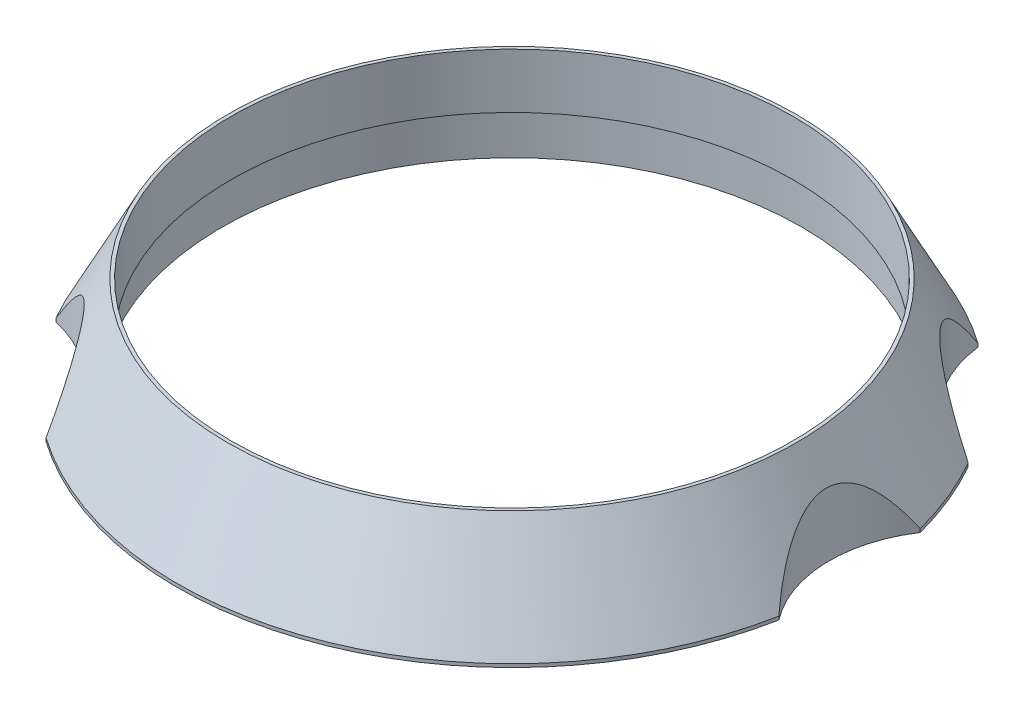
ISO-10303-21;
HEADER;
FILE_DESCRIPTION(('STEP AP214'),'2;1');
FILE_NAME('part.step','',(''),(''),'','','');
FILE_SCHEMA(('AUTOMOTIVE_DESIGN { 1 0 10303 214 1 1 1 1 }'));
ENDSEC;
DATA;
#1=APPLICATION_CONTEXT('core data for automotive mechanical design processes');
#2=APPLICATION_PROTOCOL_DEFINITION('international standard','automotive_design',2000,#1);
#3=PRODUCT_CONTEXT('',#1,'mechanical');
#4=PRODUCT('Part','Part','',(#3));
#5=PRODUCT_RELATED_PRODUCT_CATEGORY('part','',(#4));
#6=PRODUCT_DEFINITION_FORMATION('','',#4);
#7=PRODUCT_DEFINITION_CONTEXT('part definition',#1,'design');
#8=PRODUCT_DEFINITION('design','',#6,#7);
#9=PRODUCT_DEFINITION_SHAPE('','',#8);
#10=(LENGTH_UNIT() NAMED_UNIT(*) SI_UNIT(.MILLI.,.METRE.));
#11=(NAMED_UNIT(*) PLANE_ANGLE_UNIT() SI_UNIT($,.RADIAN.));
#12=(NAMED_UNIT(*) SI_UNIT($,.STERADIAN.) SOLID_ANGLE_UNIT());
#13=UNCERTAINTY_MEASURE_WITH_UNIT(LENGTH_MEASURE(1.E-05),#10,'distance_accuracy_value','');
#14=(GEOMETRIC_REPRESENTATION_CONTEXT(3) GLOBAL_UNCERTAINTY_ASSIGNED_CONTEXT((#13)) GLOBAL_UNIT_ASSIGNED_CONTEXT((#10,
#11,#12)) REPRESENTATION_CONTEXT('',''));
#15=CARTESIAN_POINT('',(0.,0.,0.));
#16=DIRECTION('',(0.,0.,1.));
#17=DIRECTION('',(1.,0.,0.));
#18=AXIS2_PLACEMENT_3D('',#15,#16,#17);
#19=CARTESIAN_POINT('',(-127.,0.,0.));
#20=DIRECTION('',(0.,1.,0.));
#21=DIRECTION('',(0.,0.,1.));
#22=AXIS2_PLACEMENT_3D('',#19,#20,#21);
#23=PLANE('',#22);
#24=CARTESIAN_POINT('',(95.7821391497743,0.,66.9242207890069));
#25=DIRECTION('',(0.,-1.,0.));
#26=DIRECTION('',(0.,0.,-1.));
#27=AXIS2_PLACEMENT_3D('',#24,#25,#26);
#28=CIRCLE('',#27,3.175);
#29=CARTESIAN_POINT('',(95.7821391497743,0.,63.7492207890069));
#30=VERTEX_POINT('',#29);
#31=EDGE_CURVE('E470',#30,#30,#28,.T.);
#32=ORIENTED_EDGE('',*,*,#31,.F.);
#33=EDGE_LOOP('',(#32));
#34=FACE_BOUND('',#33,.T.);
#35=CARTESIAN_POINT('',(-95.7821391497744,0.,-66.9242207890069));
#36=DIRECTION('',(0.,-1.,0.));
#37=DIRECTION('',(0.,0.,-1.));
#38=AXIS2_PLACEMENT_3D('',#35,#36,#37);
#39=CIRCLE('',#38,3.175);
#40=CARTESIAN_POINT('',(-95.7821391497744,0.,-70.0992207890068));
#41=VERTEX_POINT('',#40);
#42=EDGE_CURVE('E480',#41,#41,#39,.T.);
#43=ORIENTED_EDGE('',*,*,#42,.F.);
#44=EDGE_LOOP('',(#43));
#45=FACE_BOUND('',#44,.T.);
#46=CARTESIAN_POINT('',(-21.8546279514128,0.,114.784340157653));
#47=DIRECTION('',(0.,-1.,0.));
#48=DIRECTION('',(0.,0.,-1.));
#49=AXIS2_PLACEMENT_3D('',#46,#47,#48);
#50=CIRCLE('',#49,3.17499999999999);
#51=CARTESIAN_POINT('',(-21.8546279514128,0.,111.609340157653));
#52=VERTEX_POINT('',#51);
#53=EDGE_CURVE('E492',#52,#52,#50,.T.);
#54=ORIENTED_EDGE('',*,*,#53,.F.);
#55=EDGE_LOOP('',(#54));
#56=FACE_BOUND('',#55,.T.);
#57=CARTESIAN_POINT('',(0.,0.,0.));
#58=DIRECTION('',(0.,-1.,0.));
#59=DIRECTION('',(0.,0.,-1.));
#60=AXIS2_PLACEMENT_3D('',#57,#58,#59);
#61=CIRCLE('',#60,127.);
#62=CARTESIAN_POINT('',(110.378100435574,0.,-62.8146077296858));
#63=VERTEX_POINT('',#62);
#64=CARTESIAN_POINT('',(122.880059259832,0.,-32.0856827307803));
#65=VERTEX_POINT('',#64);
#66=EDGE_CURVE('E109',#63,#65,#61,.T.);
#67=ORIENTED_EDGE('',*,*,#66,.T.);
#68=CARTESIAN_POINT('',(162.780464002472,0.,-5.62143623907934));
#69=DIRECTION('',(0.,1.,0.));
#70=DIRECTION('',(0.,0.,1.));
#71=AXIS2_PLACEMENT_3D('',#68,#69,#70);
#72=CIRCLE('',#71,47.879);
#73=CARTESIAN_POINT('',(124.800762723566,0.,23.5323102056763));
#74=VERTEX_POINT('',#73);
#75=EDGE_CURVE('E94',#65,#74,#72,.T.);
#76=ORIENTED_EDGE('',*,*,#75,.T.);
#77=CARTESIAN_POINT('',(-72.9243915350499,0.,103.976118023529));
#78=VERTEX_POINT('',#77);
#79=EDGE_CURVE('E117',#74,#78,#61,.T.);
#80=ORIENTED_EDGE('',*,*,#79,.T.);
#81=CARTESIAN_POINT('',(-120.469822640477,0.,109.617981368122));
#82=DIRECTION('',(0.,1.,0.));
#83=DIRECTION('',(0.,0.,1.));
#84=AXIS2_PLACEMENT_3D('',#81,#82,#83);
#85=CIRCLE('',#84,47.879);
#86=CARTESIAN_POINT('',(-110.378100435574,0.,62.8146077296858));
#87=VERTEX_POINT('',#86);
#88=EDGE_CURVE('E211',#78,#87,#85,.T.);
#89=ORIENTED_EDGE('',*,*,#88,.T.);
#90=CARTESIAN_POINT('',(-122.880059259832,0.,32.0856827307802));
#91=VERTEX_POINT('',#90);
#92=EDGE_CURVE('E119',#87,#91,#61,.T.);
#93=ORIENTED_EDGE('',*,*,#92,.T.);
#94=CARTESIAN_POINT('',(-162.780464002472,0.,5.62143623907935));
#95=DIRECTION('',(0.,1.,0.));
#96=DIRECTION('',(0.,0.,1.));
#97=AXIS2_PLACEMENT_3D('',#94,#95,#96);
#98=CIRCLE('',#97,47.879);
#99=CARTESIAN_POINT('',(-124.800762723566,0.,-23.5323102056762));
#100=VERTEX_POINT('',#99);
#101=EDGE_CURVE('E198',#91,#100,#98,.T.);
#102=ORIENTED_EDGE('',*,*,#101,.T.);
#103=CARTESIAN_POINT('',(72.9243915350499,0.,-103.976118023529));
#104=VERTEX_POINT('',#103);
#105=EDGE_CURVE('E116',#100,#104,#61,.T.);
#106=ORIENTED_EDGE('',*,*,#105,.T.);
#107=CARTESIAN_POINT('',(120.469822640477,0.,-109.617981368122));
#108=DIRECTION('',(0.,1.,0.));
#109=DIRECTION('',(0.,0.,1.));
#110=AXIS2_PLACEMENT_3D('',#107,#108,#109);
#111=CIRCLE('',#110,47.879);
#112=EDGE_CURVE('E115',#104,#63,#111,.T.);
#113=ORIENTED_EDGE('',*,*,#112,.T.);
#114=EDGE_LOOP('',(#67,#76,#80,#89,#93,#102,#106,#113));
#115=FACE_BOUND('',#114,.T.);
#116=CARTESIAN_POINT('',(0.,0.,0.));
#117=DIRECTION('',(0.,-1.,0.));
#118=DIRECTION('',(0.,0.,-1.));
#119=AXIS2_PLACEMENT_3D('',#116,#117,#118);
#120=CIRCLE('',#119,110.045499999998);
#121=CARTESIAN_POINT('',(0.,0.,-110.045499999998));
#122=VERTEX_POINT('',#121);
#123=EDGE_CURVE('E123',#122,#122,#120,.T.);
#124=ORIENTED_EDGE('',*,*,#123,.F.);
#125=EDGE_LOOP('',(#124));
#126=FACE_BOUND('',#125,.T.);
#127=CARTESIAN_POINT('',(21.8546279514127,0.,-114.784340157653));
#128=DIRECTION('',(0.,-1.,0.));
#129=DIRECTION('',(0.,0.,-1.));
#130=AXIS2_PLACEMENT_3D('',#127,#128,#129);
#131=CIRCLE('',#130,3.17499999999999);
#132=CARTESIAN_POINT('',(21.8546279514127,0.,-117.959340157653));
#133=VERTEX_POINT('',#132);
#134=EDGE_CURVE('E504',#133,#133,#131,.T.);
#135=ORIENTED_EDGE('',*,*,#134,.F.);
#136=EDGE_LOOP('',(#135));
#137=FACE_BOUND('',#136,.T.);
#138=ADVANCED_FACE('F32',(#34,#45,#56,#115,#126,#137),#23,.F.);
#139=CARTESIAN_POINT('',(0.,0.,0.));
#140=DIRECTION('',(0.,-1.,0.));
#141=DIRECTION('',(0.,0.,-1.));
#142=AXIS2_PLACEMENT_3D('',#139,#140,#141);
#143=CYLINDRICAL_SURFACE('',#142,127.);
#144=ORIENTED_EDGE('',*,*,#79,.F.);
#145=DIRECTION('',(0.,1.,0.));
#146=VECTOR('',#145,1.);
#147=CARTESIAN_POINT('',(124.800762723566,19.05,23.5323102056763));
#148=LINE('',#147,#146);
#149=CARTESIAN_POINT('',(124.800762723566,1.27,23.5323102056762));
#150=VERTEX_POINT('',#149);
#151=EDGE_CURVE('E47',#74,#150,#148,.T.);
#152=ORIENTED_EDGE('',*,*,#151,.T.);
#153=CARTESIAN_POINT('',(0.,1.27,0.));
#154=DIRECTION('',(0.,-1.,0.));
#155=DIRECTION('',(0.,0.,-1.));
#156=AXIS2_PLACEMENT_3D('',#153,#154,#155);
#157=CIRCLE('',#156,127.);
#158=CARTESIAN_POINT('',(-72.9243915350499,1.27,103.976118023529));
#159=VERTEX_POINT('',#158);
#160=EDGE_CURVE('E242',#150,#159,#157,.T.);
#161=ORIENTED_EDGE('',*,*,#160,.T.);
#162=DIRECTION('',(0.,1.,0.));
#163=VECTOR('',#162,1.);
#164=CARTESIAN_POINT('',(-72.9243915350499,19.05,103.976118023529));
#165=LINE('',#164,#163);
#166=EDGE_CURVE('E208',#159,#78,#165,.F.);
#167=ORIENTED_EDGE('',*,*,#166,.T.);
#168=EDGE_LOOP('',(#144,#152,#161,#167));
#169=FACE_BOUND('',#168,.T.);
#170=ADVANCED_FACE('F173',(#169),#143,.T.);
#171=CARTESIAN_POINT('',(110.378100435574,1.27,-62.8146077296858));
#172=VERTEX_POINT('',#171);
#173=CARTESIAN_POINT('',(122.880059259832,1.26999999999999,-32.0856827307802));
#174=VERTEX_POINT('',#173);
#175=EDGE_CURVE('E111',#172,#174,#157,.T.);
#176=ORIENTED_EDGE('',*,*,#175,.T.);
#177=DIRECTION('',(0.,1.,0.));
#178=VECTOR('',#177,1.);
#179=CARTESIAN_POINT('',(122.880059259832,19.05,-32.0856827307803));
#180=LINE('',#179,#178);
#181=EDGE_CURVE('E97',#174,#65,#180,.F.);
#182=ORIENTED_EDGE('',*,*,#181,.T.);
#183=ORIENTED_EDGE('',*,*,#66,.F.);
#184=DIRECTION('',(0.,1.,0.));
#185=VECTOR('',#184,1.);
#186=CARTESIAN_POINT('',(110.378100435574,19.05,-62.8146077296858));
#187=LINE('',#186,#185);
#188=EDGE_CURVE('E55',#63,#172,#187,.T.);
#189=ORIENTED_EDGE('',*,*,#188,.T.);
#190=EDGE_LOOP('',(#176,#182,#183,#189));
#191=FACE_BOUND('',#190,.T.);
#192=ADVANCED_FACE('F108',(#191),#143,.T.);
#193=ORIENTED_EDGE('',*,*,#92,.F.);
#194=DIRECTION('',(0.,1.,0.));
#195=VECTOR('',#194,1.);
#196=CARTESIAN_POINT('',(-110.378100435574,19.05,62.8146077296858));
#197=LINE('',#196,#195);
#198=CARTESIAN_POINT('',(-110.378100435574,1.27,62.8146077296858));
#199=VERTEX_POINT('',#198);
#200=EDGE_CURVE('E195',#87,#199,#197,.T.);
#201=ORIENTED_EDGE('',*,*,#200,.T.);
#202=CARTESIAN_POINT('',(-122.880059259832,1.27,32.0856827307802));
#203=VERTEX_POINT('',#202);
#204=EDGE_CURVE('E120',#199,#203,#157,.T.);
#205=ORIENTED_EDGE('',*,*,#204,.T.);
#206=DIRECTION('',(0.,1.,0.));
#207=VECTOR('',#206,1.);
#208=CARTESIAN_POINT('',(-122.880059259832,19.05,32.0856827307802));
#209=LINE('',#208,#207);
#210=EDGE_CURVE('E149',#203,#91,#209,.F.);
#211=ORIENTED_EDGE('',*,*,#210,.T.);
#212=EDGE_LOOP('',(#193,#201,#205,#211));
#213=FACE_BOUND('',#212,.T.);
#214=ADVANCED_FACE('F177',(#213),#143,.T.);
#215=CARTESIAN_POINT('',(0.,0.,0.));
#216=DIRECTION('',(0.,-1.,0.));
#217=DIRECTION('',(0.,0.,-1.));
#218=AXIS2_PLACEMENT_3D('',#215,#216,#217);
#219=CYLINDRICAL_SURFACE('',#218,106.6927);
#220=CARTESIAN_POINT('',(0.,38.1,0.));
#221=DIRECTION('',(0.,-1.,0.));
#222=DIRECTION('',(0.,0.,-1.));
#223=AXIS2_PLACEMENT_3D('',#220,#221,#222);
#224=CIRCLE('',#223,106.6927);
#225=CARTESIAN_POINT('',(0.,38.1,-106.6927));
#226=VERTEX_POINT('',#225);
#227=EDGE_CURVE('E11',#226,#226,#224,.T.);
#228=ORIENTED_EDGE('',*,*,#227,.F.);
#229=EDGE_LOOP('',(#228));
#230=FACE_BOUND('',#229,.T.);
#231=CARTESIAN_POINT('',(0.,17.2720000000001,0.));
#232=DIRECTION('',(0.,-1.,0.));
#233=DIRECTION('',(0.,0.,-1.));
#234=AXIS2_PLACEMENT_3D('',#231,#232,#233);
#235=CIRCLE('',#234,106.6927);
#236=CARTESIAN_POINT('',(0.,17.2720000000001,-106.6927));
#237=VERTEX_POINT('',#236);
#238=EDGE_CURVE('E133',#237,#237,#235,.T.);
#239=ORIENTED_EDGE('',*,*,#238,.T.);
#240=EDGE_LOOP('',(#239));
#241=FACE_BOUND('',#240,.T.);
#242=ADVANCED_FACE('F34',(#230,#241),#219,.F.);
#243=CARTESIAN_POINT('',(-106.6927,38.1,0.));
#244=DIRECTION('',(0.,-1.,0.));
#245=DIRECTION('',(0.,0.,-1.));
#246=AXIS2_PLACEMENT_3D('',#243,#244,#245);
#247=PLANE('',#246);
#248=CARTESIAN_POINT('',(0.,38.1,0.));
#249=DIRECTION('',(0.,-1.,0.));
#250=DIRECTION('',(0.,0.,-1.));
#251=AXIS2_PLACEMENT_3D('',#248,#249,#250);
#252=CIRCLE('',#251,107.9627);
#253=CARTESIAN_POINT('',(0.,38.1,-107.9627));
#254=VERTEX_POINT('',#253);
#255=EDGE_CURVE('E40',#254,#254,#252,.T.);
#256=ORIENTED_EDGE('',*,*,#255,.F.);
#257=EDGE_LOOP('',(#256));
#258=FACE_BOUND('',#257,.T.);
#259=ORIENTED_EDGE('',*,*,#227,.T.);
#260=EDGE_LOOP('',(#259));
#261=FACE_BOUND('',#260,.T.);
#262=ADVANCED_FACE('F181',(#258,#261),#247,.F.);
#263=CARTESIAN_POINT('',(0.,38.1,0.));
#264=DIRECTION('',(0.,-1.,0.));
#265=DIRECTION('',(0.,0.,-1.));
#266=AXIS2_PLACEMENT_3D('',#263,#264,#265);
#267=CONICAL_SURFACE('',#266,107.9627,0.4770732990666);
#268=ORIENTED_EDGE('',*,*,#160,.F.);
#269=CARTESIAN_POINT('',(124.800847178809,1.26979999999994,23.5324202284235));
#270=CARTESIAN_POINT('',(124.629646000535,1.67522366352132,23.3093869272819));
#271=CARTESIAN_POINT('',(124.459270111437,2.07935001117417,23.0833705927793));
#272=CARTESIAN_POINT('',(124.120230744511,2.88478749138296,22.6250908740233));
#273=CARTESIAN_POINT('',(123.951567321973,3.28609853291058,22.3928272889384));
#274=CARTESIAN_POINT('',(123.448121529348,4.48575672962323,21.6860786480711));
#275=CARTESIAN_POINT('',(123.116019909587,5.27950612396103,21.2018126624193));
#276=CARTESIAN_POINT('',(122.455669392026,6.86194271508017,20.1986079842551));
#277=CARTESIAN_POINT('',(122.127518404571,7.65044699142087,19.6793155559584));
#278=CARTESIAN_POINT('',(121.480329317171,9.2089848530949,18.608481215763));
#279=CARTESIAN_POINT('',(121.161289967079,9.97902096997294,18.0569437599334));
#280=CARTESIAN_POINT('',(120.519880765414,11.5295923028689,16.8930587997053));
#281=CARTESIAN_POINT('',(120.19797233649,12.3091211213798,16.2791083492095));
#282=CARTESIAN_POINT('',(119.56733008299,13.8373842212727,15.0068940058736));
#283=CARTESIAN_POINT('',(119.258600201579,14.5861092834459,14.3486169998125));
#284=CARTESIAN_POINT('',(118.658735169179,16.0399731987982,12.9856442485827));
#285=CARTESIAN_POINT('',(118.367518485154,16.7453144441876,12.2812017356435));
#286=CARTESIAN_POINT('',(117.805003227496,18.1041318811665,10.8169709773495));
#287=CARTESIAN_POINT('',(117.53368791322,18.757651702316,10.0572303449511));
#288=CARTESIAN_POINT('',(117.129780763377,19.7247579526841,8.82264779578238));
#289=CARTESIAN_POINT('',(116.988518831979,20.0617659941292,8.36892795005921));
#290=CARTESIAN_POINT('',(116.715186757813,20.7105441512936,7.44083815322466));
#291=CARTESIAN_POINT('',(116.583118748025,21.0223084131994,6.96646345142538));
#292=CARTESIAN_POINT('',(116.330289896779,21.6147154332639,5.99875623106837));
#293=CARTESIAN_POINT('',(116.209480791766,21.8954920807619,5.50551875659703));
#294=CARTESIAN_POINT('',(115.980231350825,22.4224874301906,4.49803463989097));
#295=CARTESIAN_POINT('',(115.8717907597,22.6687068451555,3.98378843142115));
#296=CARTESIAN_POINT('',(115.667538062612,23.1247807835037,2.92639738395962));
#297=CARTESIAN_POINT('',(115.571964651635,23.3339660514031,2.38291513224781));
#298=CARTESIAN_POINT('',(115.397762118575,23.7048305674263,1.27720581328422));
#299=CARTESIAN_POINT('',(115.319132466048,23.8665113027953,0.714979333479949));
#300=CARTESIAN_POINT('',(115.180987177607,24.1365435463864,-0.423673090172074));
#301=CARTESIAN_POINT('',(115.121443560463,24.2449732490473,-1.00007690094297));
#302=CARTESIAN_POINT('',(115.023009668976,24.4044811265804,-2.16251677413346));
#303=CARTESIAN_POINT('',(114.984115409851,24.4555703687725,-2.74855095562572));
#304=CARTESIAN_POINT('',(114.931604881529,24.4954564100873,-3.84732430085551));
#305=CARTESIAN_POINT('',(114.915359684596,24.491488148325,-4.35968730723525));
#306=CARTESIAN_POINT('',(114.899331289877,24.4386787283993,-5.38229925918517));
#307=CARTESIAN_POINT('',(114.899546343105,24.3898423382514,-5.89254842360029));
#308=CARTESIAN_POINT('',(114.916038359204,24.2488337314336,-6.90717992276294));
#309=CARTESIAN_POINT('',(114.93232992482,24.156622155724,-7.41155650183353));
#310=CARTESIAN_POINT('',(114.980146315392,23.9316656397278,-8.41042495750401));
#311=CARTESIAN_POINT('',(115.011673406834,23.7989146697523,-8.90491535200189));
#312=CARTESIAN_POINT('',(115.097356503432,23.4630053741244,-9.9891903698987));
#313=CARTESIAN_POINT('',(115.154972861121,23.2507718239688,-10.5758952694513));
#314=CARTESIAN_POINT('',(115.288847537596,22.7784027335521,-11.7272848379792));
#315=CARTESIAN_POINT('',(115.36511069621,22.5182547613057,-12.2919637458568));
#316=CARTESIAN_POINT('',(115.618532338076,21.6757721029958,-13.9524472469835));
#317=CARTESIAN_POINT('',(115.820234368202,21.0317386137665,-15.0136727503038));
#318=CARTESIAN_POINT('',(116.142874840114,20.0298800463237,-16.4626894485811));
#319=CARTESIAN_POINT('',(116.244182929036,19.7185609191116,-16.8890689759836));
#320=CARTESIAN_POINT('',(116.454755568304,19.077465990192,-17.725698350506));
#321=CARTESIAN_POINT('',(116.564018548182,18.7476938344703,-18.1359513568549));
#322=CARTESIAN_POINT('',(116.902539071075,17.7340960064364,-19.344257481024));
#323=CARTESIAN_POINT('',(117.142405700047,17.0263687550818,-20.1193198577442));
#324=CARTESIAN_POINT('',(117.645827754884,15.5600348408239,-21.6180193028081));
#325=CARTESIAN_POINT('',(117.90948589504,14.8012115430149,-22.3414066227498));
#326=CARTESIAN_POINT('',(118.455490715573,13.2469051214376,-23.7393305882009));
#327=CARTESIAN_POINT('',(118.737831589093,12.4514334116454,-24.4138822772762));
#328=CARTESIAN_POINT('',(119.324034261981,10.8158520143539,-25.7328316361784));
#329=CARTESIAN_POINT('',(119.628209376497,9.97517305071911,-26.3763793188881));
#330=CARTESIAN_POINT('',(120.250808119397,8.26999263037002,-27.6240044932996));
#331=CARTESIAN_POINT('',(120.569234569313,7.40548646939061,-28.2280741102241));
#332=CARTESIAN_POINT('',(121.213732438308,5.67051389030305,-29.3920332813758));
#333=CARTESIAN_POINT('',(121.539618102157,4.80033034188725,-29.9524487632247));
#334=CARTESIAN_POINT('',(122.036505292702,3.48402436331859,-30.7695951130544));
#335=CARTESIAN_POINT('',(122.203427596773,3.04354738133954,-31.0379895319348));
#336=CARTESIAN_POINT('',(122.539864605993,2.15916863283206,-31.5673625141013));
#337=CARTESIAN_POINT('',(122.709379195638,1.71526701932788,-31.828341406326));
#338=CARTESIAN_POINT('',(122.880135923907,1.26979999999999,-32.085798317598));
#339=B_SPLINE_CURVE_WITH_KNOTS('',3,(#269,#270,#271,#272,#273,#274,#275,#276,#277,#278,#279,
#280,#281,#282,#283,#284,#285,#286,#287,#288,#289,#290,#291,#292,#293,#294,#295,#296,#297,#298,
#299,#300,#301,#302,#303,#304,#305,#306,#307,#308,#309,#310,#311,#312,#313,#314,#315,#316,#317,
#318,#319,#320,#321,#322,#323,#324,#325,#326,#327,#328,#329,#330,#331,#332,#333,#334,#335,#336,
#337,#338),.UNSPECIFIED.,.F.,.F.,(4,2,2,2,2,2,2,2,2,2,2,2,2,2,2,2,2,2,2,2,2,2,2,2,2,2,2,2,2,2,2,
2,2,2,4),(0.,1.48011246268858,2.96027256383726,5.92176999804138,8.91976233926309,
11.9173413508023,15.0456333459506,18.1748548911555,21.2881542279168,24.3988039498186,
26.1457150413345,27.8930300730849,29.6324725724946,31.3718791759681,33.1400720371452,
34.9082095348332,36.6737428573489,38.4389353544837,39.974640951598,41.5101833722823,
43.0471218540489,44.5842890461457,46.4610247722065,48.3382481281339,52.0959087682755,
53.7083665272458,55.3205068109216,58.5467888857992,61.787734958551,65.0276783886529,
68.3311151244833,71.6352088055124,74.8898497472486,76.5162214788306,78.142520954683),.UNSPECIFIED.);
#340=EDGE_CURVE('E102',#150,#174,#339,.T.);
#341=ORIENTED_EDGE('',*,*,#340,.T.);
#342=ORIENTED_EDGE('',*,*,#175,.F.);
#343=CARTESIAN_POINT('',(110.37823601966,1.2698,-62.8145784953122));
#344=CARTESIAN_POINT('',(110.103388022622,1.67522366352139,-62.8738429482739));
#345=CARTESIAN_POINT('',(109.827238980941,2.07935001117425,-62.9359157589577));
#346=CARTESIAN_POINT('',(109.272204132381,2.88478749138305,-63.0659323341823));
#347=CARTESIAN_POINT('',(108.993318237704,3.28609853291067,-63.1338762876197));
#348=CARTESIAN_POINT('',(108.152156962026,4.48575672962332,-63.3469467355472));
#349=CARTESIAN_POINT('',(107.585596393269,5.27950612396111,-63.5012650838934));
#350=CARTESIAN_POINT('',(106.432976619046,6.86194271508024,-63.8388300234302));
#351=CARTESIAN_POINT('',(105.846763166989,7.65044699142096,-64.0224096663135));
#352=CARTESIAN_POINT('',(104.660416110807,9.208984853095,-64.4200534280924));
#353=CARTESIAN_POINT('',(104.06028443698,9.97902096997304,-64.6341133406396));
#354=CARTESIAN_POINT('',(102.818132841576,11.529592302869,-65.1064409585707));
#355=CARTESIAN_POINT('',(102.175427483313,12.3091211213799,-65.3662293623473));
#356=CARTESIAN_POINT('',(100.871387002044,13.8373842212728,-65.9281167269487));
#357=CARTESIAN_POINT('',(100.21004640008,14.586109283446,-66.2302282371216));
#358=CARTESIAN_POINT('',(98.870743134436,16.0399731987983,-66.8812271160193));
#359=CARTESIAN_POINT('',(98.1928821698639,16.7453144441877,-67.2298686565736));
#360=CARTESIAN_POINT('',(96.8165330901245,18.1041318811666,-67.9822371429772));
#361=CARTESIAN_POINT('',(96.1180630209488,18.757651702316,-68.3859169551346));
#362=CARTESIAN_POINT('',(95.0112410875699,19.7247579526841,-69.0658289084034));
#363=CARTESIAN_POINT('',(94.6099466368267,20.0617659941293,-69.3203468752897));
#364=CARTESIAN_POINT('',(93.8010034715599,20.7105441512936,-69.8510747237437));
#365=CARTESIAN_POINT('',(93.3933533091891,21.0223084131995,-70.1272896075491));
#366=CARTESIAN_POINT('',(92.5744065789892,21.6147154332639,-70.7014898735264));
#367=CARTESIAN_POINT('',(92.1631347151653,21.8954920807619,-70.9993715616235));
#368=CARTESIAN_POINT('',(91.3364265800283,22.4224874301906,-71.6191563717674));
#369=CARTESIAN_POINT('',(90.9209903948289,22.6687068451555,-71.9410589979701));
#370=CARTESIAN_POINT('',(90.0810465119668,23.1247807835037,-72.615068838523));
#371=CARTESIAN_POINT('',(89.6565024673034,23.3339660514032,-72.967587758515));
#372=CARTESIAN_POINT('',(88.8082036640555,23.7048305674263,-73.6978813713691));
#373=CARTESIAN_POINT('',(88.3844488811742,23.8665113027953,-74.0756552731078));
#374=CARTESIAN_POINT('',(87.5423240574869,24.1365435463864,-74.8543973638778));
#375=CARTESIAN_POINT('',(87.1239470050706,24.2449732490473,-75.2553305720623));
#376=CARTESIAN_POINT('',(86.2967066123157,24.4044811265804,-76.0779052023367));
#377=CARTESIAN_POINT('',(85.8878414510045,24.4555703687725,-76.4995426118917));
#378=CARTESIAN_POINT('',(85.1368113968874,24.4954564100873,-77.3032926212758));
#379=CARTESIAN_POINT('',(84.7928855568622,24.491488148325,-77.6834173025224));
#380=CARTESIAN_POINT('',(84.1189528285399,24.4386787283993,-78.4527070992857));
#381=CARTESIAN_POINT('',(83.7889444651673,24.3898423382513,-78.8418712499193));
#382=CARTESIAN_POINT('',(83.1449699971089,24.2488337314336,-79.6261199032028));
#383=CARTESIAN_POINT('',(82.8310187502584,24.156622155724,-80.0212094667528));
#384=CARTESIAN_POINT('',(82.2211266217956,23.9316656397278,-80.8137094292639));
#385=CARTESIAN_POINT('',(81.9251884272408,23.7989146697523,-81.2111201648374));
#386=CARTESIAN_POINT('',(81.2889017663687,23.4630053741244,-82.0932387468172));
#387=CARTESIAN_POINT('',(80.9531843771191,23.2507718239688,-82.5778376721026));
#388=CARTESIAN_POINT('',(80.3102114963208,22.7784027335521,-83.5423096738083));
#389=CARTESIAN_POINT('',(80.0029634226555,22.5182547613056,-84.0221814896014));
#390=CARTESIAN_POINT('',(79.1217109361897,21.6757721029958,-85.4521542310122));
#391=CARTESIAN_POINT('',(78.5887945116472,21.0317386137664,-86.3917729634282));
#392=CARTESIAN_POINT('',(77.8971520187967,20.0298800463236,-87.7053090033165));
#393=CARTESIAN_POINT('',(77.6984895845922,19.7185609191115,-88.0959444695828));
#394=CARTESIAN_POINT('',(77.3176680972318,19.0774659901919,-88.8700662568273));
#395=CARTESIAN_POINT('',(77.1355058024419,18.7476938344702,-89.2535539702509));
#396=CARTESIAN_POINT('',(76.6117297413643,17.7340960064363,-90.3938427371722));
#397=CARTESIAN_POINT('',(76.2930814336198,17.0263687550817,-91.1399800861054));
#398=CARTESIAN_POINT('',(75.7071219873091,15.5600348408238,-92.6083755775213));
#399=CARTESIAN_POINT('',(75.4400507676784,14.8012115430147,-93.3305097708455));
#400=CARTESIAN_POINT('',(74.951767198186,13.2469051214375,-94.7496263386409));
#401=CARTESIAN_POINT('',(74.7305406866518,12.4514334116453,-95.4466164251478));
#402=CARTESIAN_POINT('',(74.3240077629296,10.8158520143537,-96.8315322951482));
#403=CARTESIAN_POINT('',(74.1394902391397,9.97517305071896,-97.5190127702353));
#404=CARTESIAN_POINT('',(73.8068589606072,8.26999263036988,-98.8731007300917));
#405=CARTESIAN_POINT('',(73.6587524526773,7.40548646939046,-99.5397040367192));
#406=CARTESIAN_POINT('',(73.3969561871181,5.67051389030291,-100.844173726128));
#407=CARTESIAN_POINT('',(73.2827844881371,4.80033034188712,-101.482320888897));
#408=CARTESIAN_POINT('',(73.1328624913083,3.48402436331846,-102.426856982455));
#409=CARTESIAN_POINT('',(73.0864548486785,3.0435473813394,-102.739498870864));
#410=CARTESIAN_POINT('',(73.000414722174,2.15916863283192,-103.360806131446));
#411=CARTESIAN_POINT('',(72.9607819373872,1.71526701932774,-103.669471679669));
#412=CARTESIAN_POINT('',(72.9243751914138,1.26979999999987,-103.976255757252));
#413=B_SPLINE_CURVE_WITH_KNOTS('',3,(#343,#344,#345,#346,#347,#348,#349,#350,#351,#352,#353,
#354,#355,#356,#357,#358,#359,#360,#361,#362,#363,#364,#365,#366,#367,#368,#369,#370,#371,#372,
#373,#374,#375,#376,#377,#378,#379,#380,#381,#382,#383,#384,#385,#386,#387,#388,#389,#390,#391,
#392,#393,#394,#395,#396,#397,#398,#399,#400,#401,#402,#403,#404,#405,#406,#407,#408,#409,#410,
#411,#412),.UNSPECIFIED.,.F.,.F.,(4,2,2,2,2,2,2,2,2,2,2,2,2,2,2,2,2,2,2,2,2,2,2,2,2,2,2,2,2,2,2,
2,2,2,4),(0.,1.48011246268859,2.96027256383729,5.92176999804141,8.91976233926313,
11.9173413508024,15.0456333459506,18.1748548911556,21.2881542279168,24.3988039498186,
26.1457150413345,27.893030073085,29.6324725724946,31.3718791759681,33.1400720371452,
34.9082095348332,36.6737428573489,38.4389353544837,39.974640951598,41.5101833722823,
43.0471218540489,44.5842890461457,46.4610247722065,48.3382481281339,52.0959087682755,
53.7083665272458,55.3205068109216,58.5467888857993,61.787734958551,65.027678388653,
68.3311151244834,71.6352088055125,74.8898497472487,76.5162214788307,78.142520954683),.UNSPECIFIED.);
#414=CARTESIAN_POINT('',(72.9243915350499,1.27000000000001,-103.976118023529));
#415=VERTEX_POINT('',#414);
#416=EDGE_CURVE('E214',#172,#415,#413,.T.);
#417=ORIENTED_EDGE('',*,*,#416,.T.);
#418=CARTESIAN_POINT('',(-124.800762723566,1.27,-23.5323102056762));
#419=VERTEX_POINT('',#418);
#420=EDGE_CURVE('E239',#419,#415,#157,.T.);
#421=ORIENTED_EDGE('',*,*,#420,.F.);
#422=CARTESIAN_POINT('',(-124.800847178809,1.26979999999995,-23.5324202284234));
#423=CARTESIAN_POINT('',(-124.629646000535,1.67522366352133,-23.3093869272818));
#424=CARTESIAN_POINT('',(-124.459270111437,2.07935001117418,-23.0833705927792));
#425=CARTESIAN_POINT('',(-124.120230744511,2.88478749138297,-22.6250908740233));
#426=CARTESIAN_POINT('',(-123.951567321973,3.2860985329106,-22.3928272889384));
#427=CARTESIAN_POINT('',(-123.448121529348,4.48575672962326,-21.686078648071));
#428=CARTESIAN_POINT('',(-123.116019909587,5.27950612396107,-21.2018126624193));
#429=CARTESIAN_POINT('',(-122.455669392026,6.8619427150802,-20.1986079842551));
#430=CARTESIAN_POINT('',(-122.127518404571,7.65044699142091,-19.6793155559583));
#431=CARTESIAN_POINT('',(-121.48032931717,9.20898485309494,-18.6084812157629));
#432=CARTESIAN_POINT('',(-121.161289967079,9.97902096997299,-18.0569437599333));
#433=CARTESIAN_POINT('',(-120.519880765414,11.5295923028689,-16.8930587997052));
#434=CARTESIAN_POINT('',(-120.19797233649,12.3091211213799,-16.2791083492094));
#435=CARTESIAN_POINT('',(-119.56733008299,13.8373842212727,-15.0068940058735));
#436=CARTESIAN_POINT('',(-119.258600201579,14.586109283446,-14.3486169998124));
#437=CARTESIAN_POINT('',(-118.658735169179,16.0399731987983,-12.9856442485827));
#438=CARTESIAN_POINT('',(-118.367518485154,16.7453144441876,-12.2812017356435));
#439=CARTESIAN_POINT('',(-117.805003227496,18.1041318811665,-10.8169709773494));
#440=CARTESIAN_POINT('',(-117.53368791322,18.757651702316,-10.0572303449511));
#441=CARTESIAN_POINT('',(-117.129780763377,19.724757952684,-8.82264779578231));
#442=CARTESIAN_POINT('',(-116.988518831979,20.0617659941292,-8.36892795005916));
#443=CARTESIAN_POINT('',(-116.715186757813,20.7105441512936,-7.44083815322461));
#444=CARTESIAN_POINT('',(-116.583118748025,21.0223084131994,-6.96646345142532));
#445=CARTESIAN_POINT('',(-116.330289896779,21.6147154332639,-5.99875623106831));
#446=CARTESIAN_POINT('',(-116.209480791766,21.8954920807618,-5.50551875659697));
#447=CARTESIAN_POINT('',(-115.980231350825,22.4224874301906,-4.49803463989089));
#448=CARTESIAN_POINT('',(-115.8717907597,22.6687068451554,-3.98378843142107));
#449=CARTESIAN_POINT('',(-115.667538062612,23.1247807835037,-2.92639738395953));
#450=CARTESIAN_POINT('',(-115.571964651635,23.3339660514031,-2.38291513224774));
#451=CARTESIAN_POINT('',(-115.397762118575,23.7048305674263,-1.27720581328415));
#452=CARTESIAN_POINT('',(-115.319132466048,23.8665113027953,-0.714979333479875));
#453=CARTESIAN_POINT('',(-115.180987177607,24.1365435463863,0.423673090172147));
#454=CARTESIAN_POINT('',(-115.121443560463,24.2449732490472,1.00007690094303));
#455=CARTESIAN_POINT('',(-115.023009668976,24.4044811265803,2.16251677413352));
#456=CARTESIAN_POINT('',(-114.984115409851,24.4555703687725,2.74855095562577));
#457=CARTESIAN_POINT('',(-114.931604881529,24.4954564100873,3.84732430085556));
#458=CARTESIAN_POINT('',(-114.915359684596,24.4914881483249,4.3596873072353));
#459=CARTESIAN_POINT('',(-114.899331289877,24.4386787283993,5.38229925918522));
#460=CARTESIAN_POINT('',(-114.899546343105,24.3898423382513,5.89254842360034));
#461=CARTESIAN_POINT('',(-114.916038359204,24.2488337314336,6.90717992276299));
#462=CARTESIAN_POINT('',(-114.93232992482,24.156622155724,7.41155650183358));
#463=CARTESIAN_POINT('',(-114.980146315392,23.9316656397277,8.41042495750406));
#464=CARTESIAN_POINT('',(-115.011673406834,23.7989146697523,8.90491535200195));
#465=CARTESIAN_POINT('',(-115.097356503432,23.4630053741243,9.98919036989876));
#466=CARTESIAN_POINT('',(-115.154972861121,23.2507718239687,10.5758952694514));
#467=CARTESIAN_POINT('',(-115.288847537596,22.778402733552,11.7272848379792));
#468=CARTESIAN_POINT('',(-115.36511069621,22.5182547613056,12.2919637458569));
#469=CARTESIAN_POINT('',(-115.618532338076,21.6757721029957,13.9524472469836));
#470=CARTESIAN_POINT('',(-115.820234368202,21.0317386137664,15.0136727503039));
#471=CARTESIAN_POINT('',(-116.142874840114,20.0298800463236,16.4626894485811));
#472=CARTESIAN_POINT('',(-116.244182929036,19.7185609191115,16.8890689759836));
#473=CARTESIAN_POINT('',(-116.454755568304,19.0774659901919,17.7256983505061));
#474=CARTESIAN_POINT('',(-116.564018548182,18.7476938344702,18.1359513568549));
#475=CARTESIAN_POINT('',(-116.902539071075,17.7340960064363,19.3442574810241));
#476=CARTESIAN_POINT('',(-117.142405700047,17.0263687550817,20.1193198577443));
#477=CARTESIAN_POINT('',(-117.645827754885,15.5600348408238,21.6180193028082));
#478=CARTESIAN_POINT('',(-117.90948589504,14.8012115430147,22.3414066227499));
#479=CARTESIAN_POINT('',(-118.455490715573,13.2469051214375,23.739330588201));
#480=CARTESIAN_POINT('',(-118.737831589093,12.4514334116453,24.4138822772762));
#481=CARTESIAN_POINT('',(-119.324034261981,10.8158520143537,25.7328316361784));
#482=CARTESIAN_POINT('',(-119.628209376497,9.97517305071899,26.3763793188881));
#483=CARTESIAN_POINT('',(-120.250808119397,8.26999263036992,27.6240044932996));
#484=CARTESIAN_POINT('',(-120.569234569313,7.40548646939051,28.2280741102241));
#485=CARTESIAN_POINT('',(-121.213732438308,5.67051389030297,29.3920332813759));
#486=CARTESIAN_POINT('',(-121.539618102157,4.80033034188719,29.9524487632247));
#487=CARTESIAN_POINT('',(-122.036505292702,3.48402436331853,30.7695951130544));
#488=CARTESIAN_POINT('',(-122.203427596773,3.04354738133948,31.0379895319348));
#489=CARTESIAN_POINT('',(-122.539864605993,2.159168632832,31.5673625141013));
#490=CARTESIAN_POINT('',(-122.709379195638,1.71526701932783,31.828341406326));
#491=CARTESIAN_POINT('',(-122.880135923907,1.26979999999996,32.085798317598));
#492=B_SPLINE_CURVE_WITH_KNOTS('',3,(#422,#423,#424,#425,#426,#427,#428,#429,#430,#431,#432,
#433,#434,#435,#436,#437,#438,#439,#440,#441,#442,#443,#444,#445,#446,#447,#448,#449,#450,#451,
#452,#453,#454,#455,#456,#457,#458,#459,#460,#461,#462,#463,#464,#465,#466,#467,#468,#469,#470,
#471,#472,#473,#474,#475,#476,#477,#478,#479,#480,#481,#482,#483,#484,#485,#486,#487,#488,#489,
#490,#491),.UNSPECIFIED.,.F.,.F.,(4,2,2,2,2,2,2,2,2,2,2,2,2,2,2,2,2,2,2,2,2,2,2,2,2,2,2,2,2,2,2,
2,2,2,4),(0.,1.48011246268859,2.96027256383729,5.92176999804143,8.91976233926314,
11.9173413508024,15.0456333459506,18.1748548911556,21.2881542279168,24.3988039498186,
26.1457150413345,27.8930300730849,29.6324725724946,31.3718791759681,33.1400720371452,
34.9082095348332,36.6737428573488,38.4389353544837,39.974640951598,41.5101833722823,
43.0471218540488,44.5842890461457,46.4610247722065,48.3382481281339,52.0959087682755,
53.7083665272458,55.3205068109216,58.5467888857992,61.787734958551,65.027678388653,
68.3311151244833,71.6352088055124,74.8898497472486,76.5162214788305,78.1425209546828),.UNSPECIFIED.);
#493=EDGE_CURVE('E141',#419,#203,#492,.T.);
#494=ORIENTED_EDGE('',*,*,#493,.T.);
#495=ORIENTED_EDGE('',*,*,#204,.F.);
#496=CARTESIAN_POINT('',(-110.37823601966,1.2698,62.8145784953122));
#497=CARTESIAN_POINT('',(-110.103388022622,1.67522366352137,62.8738429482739));
#498=CARTESIAN_POINT('',(-109.827238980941,2.07935001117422,62.9359157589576));
#499=CARTESIAN_POINT('',(-109.272204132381,2.88478749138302,63.0659323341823));
#500=CARTESIAN_POINT('',(-108.993318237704,3.28609853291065,63.1338762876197));
#501=CARTESIAN_POINT('',(-108.152156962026,4.48575672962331,63.3469467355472));
#502=CARTESIAN_POINT('',(-107.585596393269,5.2795061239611,63.5012650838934));
#503=CARTESIAN_POINT('',(-106.432976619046,6.86194271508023,63.8388300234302));
#504=CARTESIAN_POINT('',(-105.846763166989,7.65044699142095,64.0224096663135));
#505=CARTESIAN_POINT('',(-104.660416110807,9.20898485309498,64.4200534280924));
#506=CARTESIAN_POINT('',(-104.06028443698,9.97902096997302,64.6341133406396));
#507=CARTESIAN_POINT('',(-102.818132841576,11.529592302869,65.1064409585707));
#508=CARTESIAN_POINT('',(-102.175427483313,12.3091211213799,65.3662293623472));
#509=CARTESIAN_POINT('',(-100.871387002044,13.8373842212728,65.9281167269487));
#510=CARTESIAN_POINT('',(-100.21004640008,14.586109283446,66.2302282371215));
#511=CARTESIAN_POINT('',(-98.870743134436,16.0399731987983,66.8812271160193));
#512=CARTESIAN_POINT('',(-98.192882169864,16.7453144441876,67.2298686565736));
#513=CARTESIAN_POINT('',(-96.8165330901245,18.1041318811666,67.9822371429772));
#514=CARTESIAN_POINT('',(-96.1180630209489,18.7576517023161,68.3859169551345));
#515=CARTESIAN_POINT('',(-95.0112410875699,19.7247579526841,69.0658289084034));
#516=CARTESIAN_POINT('',(-94.6099466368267,20.0617659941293,69.3203468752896));
#517=CARTESIAN_POINT('',(-93.8010034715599,20.7105441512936,69.8510747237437));
#518=CARTESIAN_POINT('',(-93.3933533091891,21.0223084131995,70.1272896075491));
#519=CARTESIAN_POINT('',(-92.5744065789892,21.6147154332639,70.7014898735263));
#520=CARTESIAN_POINT('',(-92.1631347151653,21.8954920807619,70.9993715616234));
#521=CARTESIAN_POINT('',(-91.3364265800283,22.4224874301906,71.6191563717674));
#522=CARTESIAN_POINT('',(-90.9209903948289,22.6687068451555,71.9410589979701));
#523=CARTESIAN_POINT('',(-90.0810465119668,23.1247807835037,72.615068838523));
#524=CARTESIAN_POINT('',(-89.6565024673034,23.3339660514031,72.967587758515));
#525=CARTESIAN_POINT('',(-88.8082036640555,23.7048305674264,73.697881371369));
#526=CARTESIAN_POINT('',(-88.3844488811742,23.8665113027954,74.0756552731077));
#527=CARTESIAN_POINT('',(-87.5423240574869,24.1365435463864,74.8543973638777));
#528=CARTESIAN_POINT('',(-87.1239470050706,24.2449732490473,75.2553305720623));
#529=CARTESIAN_POINT('',(-86.2967066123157,24.4044811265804,76.0779052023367));
#530=CARTESIAN_POINT('',(-85.8878414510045,24.4555703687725,76.4995426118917));
#531=CARTESIAN_POINT('',(-85.1368113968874,24.4954564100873,77.3032926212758));
#532=CARTESIAN_POINT('',(-84.7928855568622,24.491488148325,77.6834173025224));
#533=CARTESIAN_POINT('',(-84.1189528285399,24.4386787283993,78.4527070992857));
#534=CARTESIAN_POINT('',(-83.7889444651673,24.3898423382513,78.8418712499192));
#535=CARTESIAN_POINT('',(-83.144969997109,24.2488337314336,79.6261199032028));
#536=CARTESIAN_POINT('',(-82.8310187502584,24.156622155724,80.0212094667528));
#537=CARTESIAN_POINT('',(-82.2211266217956,23.9316656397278,80.8137094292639));
#538=CARTESIAN_POINT('',(-81.9251884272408,23.7989146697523,81.2111201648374));
#539=CARTESIAN_POINT('',(-81.2889017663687,23.4630053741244,82.0932387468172));
#540=CARTESIAN_POINT('',(-80.9531843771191,23.2507718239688,82.5778376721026));
#541=CARTESIAN_POINT('',(-80.3102114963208,22.7784027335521,83.5423096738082));
#542=CARTESIAN_POINT('',(-80.0029634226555,22.5182547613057,84.0221814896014));
#543=CARTESIAN_POINT('',(-79.1217109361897,21.6757721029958,85.4521542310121));
#544=CARTESIAN_POINT('',(-78.5887945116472,21.0317386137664,86.3917729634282));
#545=CARTESIAN_POINT('',(-77.8971520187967,20.0298800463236,87.7053090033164));
#546=CARTESIAN_POINT('',(-77.6984895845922,19.7185609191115,88.0959444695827));
#547=CARTESIAN_POINT('',(-77.3176680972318,19.077465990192,88.8700662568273));
#548=CARTESIAN_POINT('',(-77.1355058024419,18.7476938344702,89.2535539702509));
#549=CARTESIAN_POINT('',(-76.6117297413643,17.7340960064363,90.3938427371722));
#550=CARTESIAN_POINT('',(-76.2930814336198,17.0263687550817,91.1399800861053));
#551=CARTESIAN_POINT('',(-75.7071219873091,15.5600348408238,92.6083755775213));
#552=CARTESIAN_POINT('',(-75.4400507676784,14.8012115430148,93.3305097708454));
#553=CARTESIAN_POINT('',(-74.951767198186,13.2469051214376,94.7496263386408));
#554=CARTESIAN_POINT('',(-74.7305406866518,12.4514334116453,95.4466164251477));
#555=CARTESIAN_POINT('',(-74.3240077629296,10.8158520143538,96.8315322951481));
#556=CARTESIAN_POINT('',(-74.1394902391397,9.97517305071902,97.5190127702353));
#557=CARTESIAN_POINT('',(-73.8068589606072,8.26999263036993,98.8731007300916));
#558=CARTESIAN_POINT('',(-73.6587524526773,7.4054864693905,99.5397040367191));
#559=CARTESIAN_POINT('',(-73.3969561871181,5.67051389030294,100.844173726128));
#560=CARTESIAN_POINT('',(-73.2827844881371,4.80033034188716,101.482320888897));
#561=CARTESIAN_POINT('',(-73.1328624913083,3.48402436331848,102.426856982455));
#562=CARTESIAN_POINT('',(-73.0864548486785,3.04354738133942,102.739498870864));
#563=CARTESIAN_POINT('',(-73.000414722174,2.15916863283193,103.360806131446));
#564=CARTESIAN_POINT('',(-72.9607819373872,1.71526701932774,103.669471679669));
#565=CARTESIAN_POINT('',(-72.9243751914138,1.26979999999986,103.976255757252));
#566=B_SPLINE_CURVE_WITH_KNOTS('',3,(#496,#497,#498,#499,#500,#501,#502,#503,#504,#505,#506,
#507,#508,#509,#510,#511,#512,#513,#514,#515,#516,#517,#518,#519,#520,#521,#522,#523,#524,#525,
#526,#527,#528,#529,#530,#531,#532,#533,#534,#535,#536,#537,#538,#539,#540,#541,#542,#543,#544,
#545,#546,#547,#548,#549,#550,#551,#552,#553,#554,#555,#556,#557,#558,#559,#560,#561,#562,#563,
#564,#565),.UNSPECIFIED.,.F.,.F.,(4,2,2,2,2,2,2,2,2,2,2,2,2,2,2,2,2,2,2,2,2,2,2,2,2,2,2,2,2,2,2,
2,2,2,4),(0.,1.48011246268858,2.96027256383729,5.92176999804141,8.91976233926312,
11.9173413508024,15.0456333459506,18.1748548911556,21.2881542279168,24.3988039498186,
26.1457150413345,27.893030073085,29.6324725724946,31.3718791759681,33.1400720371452,
34.9082095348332,36.6737428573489,38.4389353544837,39.974640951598,41.5101833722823,
43.0471218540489,44.5842890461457,46.4610247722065,48.3382481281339,52.0959087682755,
53.7083665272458,55.3205068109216,58.5467888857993,61.787734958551,65.027678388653,
68.3311151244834,71.6352088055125,74.8898497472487,76.5162214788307,78.1425209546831),.UNSPECIFIED.);
#567=EDGE_CURVE('E200',#199,#159,#566,.T.);
#568=ORIENTED_EDGE('',*,*,#567,.T.);
#569=EDGE_LOOP('',(#268,#341,#342,#417,#421,#494,#495,#568));
#570=FACE_BOUND('',#569,.T.);
#571=ORIENTED_EDGE('',*,*,#255,.T.);
#572=EDGE_LOOP('',(#571));
#573=FACE_BOUND('',#572,.T.);
#574=ADVANCED_FACE('F151',(#570,#573),#267,.T.);
#575=ORIENTED_EDGE('',*,*,#420,.T.);
#576=DIRECTION('',(0.,1.,0.));
#577=VECTOR('',#576,1.);
#578=CARTESIAN_POINT('',(72.9243915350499,19.05,-103.976118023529));
#579=LINE('',#578,#577);
#580=EDGE_CURVE('E220',#415,#104,#579,.F.);
#581=ORIENTED_EDGE('',*,*,#580,.T.);
#582=ORIENTED_EDGE('',*,*,#105,.F.);
#583=DIRECTION('',(0.,1.,0.));
#584=VECTOR('',#583,1.);
#585=CARTESIAN_POINT('',(-124.800762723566,19.05,-23.5323102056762));
#586=LINE('',#585,#584);
#587=EDGE_CURVE('E138',#100,#419,#586,.T.);
#588=ORIENTED_EDGE('',*,*,#587,.T.);
#589=EDGE_LOOP('',(#575,#581,#582,#588));
#590=FACE_BOUND('',#589,.T.);
#591=ADVANCED_FACE('F170',(#590),#143,.T.);
#592=CARTESIAN_POINT('',(0.,0.,0.));
#593=DIRECTION('',(0.,-1.,0.));
#594=DIRECTION('',(0.,0.,-1.));
#595=AXIS2_PLACEMENT_3D('',#592,#593,#594);
#596=CYLINDRICAL_SURFACE('',#595,110.045499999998);
#597=CARTESIAN_POINT('',(0.,17.2720000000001,0.));
#598=DIRECTION('',(0.,-1.,0.));
#599=DIRECTION('',(0.,0.,-1.));
#600=AXIS2_PLACEMENT_3D('',#597,#598,#599);
#601=CIRCLE('',#600,110.045499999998);
#602=CARTESIAN_POINT('',(0.,17.2720000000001,-110.045499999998));
#603=VERTEX_POINT('',#602);
#604=EDGE_CURVE('E129',#603,#603,#601,.T.);
#605=ORIENTED_EDGE('',*,*,#604,.F.);
#606=EDGE_LOOP('',(#605));
#607=FACE_BOUND('',#606,.T.);
#608=ORIENTED_EDGE('',*,*,#123,.T.);
#609=EDGE_LOOP('',(#608));
#610=FACE_BOUND('',#609,.T.);
#611=ADVANCED_FACE('F166',(#607,#610),#596,.F.);
#612=CARTESIAN_POINT('',(-110.045499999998,17.2720000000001,0.));
#613=DIRECTION('',(0.,1.,0.));
#614=DIRECTION('',(0.,0.,1.));
#615=AXIS2_PLACEMENT_3D('',#612,#613,#614);
#616=PLANE('',#615);
#617=ORIENTED_EDGE('',*,*,#238,.F.);
#618=EDGE_LOOP('',(#617));
#619=FACE_BOUND('',#618,.T.);
#620=ORIENTED_EDGE('',*,*,#604,.T.);
#621=EDGE_LOOP('',(#620));
#622=FACE_BOUND('',#621,.T.);
#623=ADVANCED_FACE('F160',(#619,#622),#616,.F.);
#624=CARTESIAN_POINT('',(-162.780464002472,0.,5.62143623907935));
#625=DIRECTION('',(0.,1.,0.));
#626=DIRECTION('',(0.,0.,1.));
#627=AXIS2_PLACEMENT_3D('',#624,#625,#626);
#628=CYLINDRICAL_SURFACE('',#627,47.879);
#629=ORIENTED_EDGE('',*,*,#101,.F.);
#630=ORIENTED_EDGE('',*,*,#210,.F.);
#631=ORIENTED_EDGE('',*,*,#493,.F.);
#632=ORIENTED_EDGE('',*,*,#587,.F.);
#633=EDGE_LOOP('',(#629,#630,#631,#632));
#634=FACE_BOUND('',#633,.T.);
#635=ADVANCED_FACE('F154',(#634),#628,.F.);
#636=CARTESIAN_POINT('',(-120.469822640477,0.,109.617981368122));
#637=DIRECTION('',(0.,1.,0.));
#638=DIRECTION('',(0.,0.,1.));
#639=AXIS2_PLACEMENT_3D('',#636,#637,#638);
#640=CYLINDRICAL_SURFACE('',#639,47.879);
#641=ORIENTED_EDGE('',*,*,#88,.F.);
#642=ORIENTED_EDGE('',*,*,#166,.F.);
#643=ORIENTED_EDGE('',*,*,#567,.F.);
#644=ORIENTED_EDGE('',*,*,#200,.F.);
#645=EDGE_LOOP('',(#641,#642,#643,#644));
#646=FACE_BOUND('',#645,.T.);
#647=ADVANCED_FACE('F159',(#646),#640,.F.);
#648=CARTESIAN_POINT('',(120.469822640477,0.,-109.617981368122));
#649=DIRECTION('',(0.,1.,0.));
#650=DIRECTION('',(0.,0.,1.));
#651=AXIS2_PLACEMENT_3D('',#648,#649,#650);
#652=CYLINDRICAL_SURFACE('',#651,47.879);
#653=ORIENTED_EDGE('',*,*,#112,.F.);
#654=ORIENTED_EDGE('',*,*,#580,.F.);
#655=ORIENTED_EDGE('',*,*,#416,.F.);
#656=ORIENTED_EDGE('',*,*,#188,.F.);
#657=EDGE_LOOP('',(#653,#654,#655,#656));
#658=FACE_BOUND('',#657,.T.);
#659=ADVANCED_FACE('F222',(#658),#652,.F.);
#660=CARTESIAN_POINT('',(162.780464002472,0.,-5.62143623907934));
#661=DIRECTION('',(0.,1.,0.));
#662=DIRECTION('',(0.,0.,1.));
#663=AXIS2_PLACEMENT_3D('',#660,#661,#662);
#664=CYLINDRICAL_SURFACE('',#663,47.879);
#665=ORIENTED_EDGE('',*,*,#75,.F.);
#666=ORIENTED_EDGE('',*,*,#181,.F.);
#667=ORIENTED_EDGE('',*,*,#340,.F.);
#668=ORIENTED_EDGE('',*,*,#151,.F.);
#669=EDGE_LOOP('',(#665,#666,#667,#668));
#670=FACE_BOUND('',#669,.T.);
#671=ADVANCED_FACE('F96',(#670),#664,.F.);
#672=CARTESIAN_POINT('',(21.8546279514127,12.7,-114.784340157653));
#673=DIRECTION('',(0.,1.,0.));
#674=DIRECTION('',(0.,0.,1.));
#675=AXIS2_PLACEMENT_3D('',#672,#673,#674);
#676=PLANE('',#675);
#677=CARTESIAN_POINT('',(21.8546279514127,12.7,-114.784340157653));
#678=DIRECTION('',(0.,-1.,0.));
#679=DIRECTION('',(0.,0.,-1.));
#680=AXIS2_PLACEMENT_3D('',#677,#678,#679);
#681=CIRCLE('',#680,2.5527);
#682=CARTESIAN_POINT('',(21.8546279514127,12.7,-117.337040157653));
#683=VERTEX_POINT('',#682);
#684=EDGE_CURVE('E103',#683,#683,#681,.T.);
#685=ORIENTED_EDGE('',*,*,#684,.T.);
#686=EDGE_LOOP('',(#685));
#687=FACE_BOUND('',#686,.T.);
#688=ADVANCED_FACE('F229',(#687),#676,.F.);
#689=CARTESIAN_POINT('',(21.8546279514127,0.,-114.784340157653));
#690=DIRECTION('',(0.,-1.,0.));
#691=DIRECTION('',(0.,0.,-1.));
#692=AXIS2_PLACEMENT_3D('',#689,#690,#691);
#693=CYLINDRICAL_SURFACE('',#692,2.5527);
#694=ORIENTED_EDGE('',*,*,#684,.F.);
#695=EDGE_LOOP('',(#694));
#696=FACE_BOUND('',#695,.T.);
#697=CARTESIAN_POINT('',(21.8546279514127,8.89,-114.784340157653));
#698=DIRECTION('',(0.,-1.,0.));
#699=DIRECTION('',(0.,0.,-1.));
#700=AXIS2_PLACEMENT_3D('',#697,#698,#699);
#701=CIRCLE('',#700,2.5527);
#702=CARTESIAN_POINT('',(21.8546279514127,8.89,-117.337040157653));
#703=VERTEX_POINT('',#702);
#704=EDGE_CURVE('E510',#703,#703,#701,.T.);
#705=ORIENTED_EDGE('',*,*,#704,.T.);
#706=EDGE_LOOP('',(#705));
#707=FACE_BOUND('',#706,.T.);
#708=ADVANCED_FACE('F312',(#696,#707),#693,.F.);
#709=CARTESIAN_POINT('',(24.4073279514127,8.89,-114.784340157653));
#710=DIRECTION('',(0.,1.,0.));
#711=DIRECTION('',(0.,0.,1.));
#712=AXIS2_PLACEMENT_3D('',#709,#710,#711);
#713=PLANE('',#712);
#714=ORIENTED_EDGE('',*,*,#704,.F.);
#715=EDGE_LOOP('',(#714));
#716=FACE_BOUND('',#715,.T.);
#717=CARTESIAN_POINT('',(21.8546279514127,8.89,-114.784340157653));
#718=DIRECTION('',(0.,-1.,0.));
#719=DIRECTION('',(0.,0.,-1.));
#720=AXIS2_PLACEMENT_3D('',#717,#718,#719);
#721=CIRCLE('',#720,3.175);
#722=CARTESIAN_POINT('',(21.8546279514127,8.89,-117.959340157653));
#723=VERTEX_POINT('',#722);
#724=EDGE_CURVE('E507',#723,#723,#721,.T.);
#725=ORIENTED_EDGE('',*,*,#724,.T.);
#726=EDGE_LOOP('',(#725));
#727=FACE_BOUND('',#726,.T.);
#728=ADVANCED_FACE('F321',(#716,#727),#713,.F.);
#729=CARTESIAN_POINT('',(21.8546279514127,0.,-114.784340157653));
#730=DIRECTION('',(0.,-1.,0.));
#731=DIRECTION('',(0.,0.,-1.));
#732=AXIS2_PLACEMENT_3D('',#729,#730,#731);
#733=CYLINDRICAL_SURFACE('',#732,3.175);
#734=ORIENTED_EDGE('',*,*,#724,.F.);
#735=EDGE_LOOP('',(#734));
#736=FACE_BOUND('',#735,.T.);
#737=ORIENTED_EDGE('',*,*,#134,.T.);
#738=EDGE_LOOP('',(#737));
#739=FACE_BOUND('',#738,.T.);
#740=ADVANCED_FACE('F330',(#736,#739),#733,.F.);
#741=CARTESIAN_POINT('',(-21.8546279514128,12.7,114.784340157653));
#742=DIRECTION('',(0.,1.,0.));
#743=DIRECTION('',(0.,0.,1.));
#744=AXIS2_PLACEMENT_3D('',#741,#742,#743);
#745=PLANE('',#744);
#746=CARTESIAN_POINT('',(-21.8546279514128,12.7,114.784340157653));
#747=DIRECTION('',(0.,-1.,0.));
#748=DIRECTION('',(0.,0.,-1.));
#749=AXIS2_PLACEMENT_3D('',#746,#747,#748);
#750=CIRCLE('',#749,2.5527);
#751=CARTESIAN_POINT('',(-21.8546279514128,12.7,112.231640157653));
#752=VERTEX_POINT('',#751);
#753=EDGE_CURVE('E501',#752,#752,#750,.T.);
#754=ORIENTED_EDGE('',*,*,#753,.T.);
#755=EDGE_LOOP('',(#754));
#756=FACE_BOUND('',#755,.T.);
#757=ADVANCED_FACE('F340',(#756),#745,.F.);
#758=CARTESIAN_POINT('',(-21.8546279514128,0.,114.784340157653));
#759=DIRECTION('',(0.,-1.,0.));
#760=DIRECTION('',(0.,0.,-1.));
#761=AXIS2_PLACEMENT_3D('',#758,#759,#760);
#762=CYLINDRICAL_SURFACE('',#761,2.5527);
#763=ORIENTED_EDGE('',*,*,#753,.F.);
#764=EDGE_LOOP('',(#763));
#765=FACE_BOUND('',#764,.T.);
#766=CARTESIAN_POINT('',(-21.8546279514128,8.89,114.784340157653));
#767=DIRECTION('',(0.,-1.,0.));
#768=DIRECTION('',(0.,0.,-1.));
#769=AXIS2_PLACEMENT_3D('',#766,#767,#768);
#770=CIRCLE('',#769,2.5527);
#771=CARTESIAN_POINT('',(-21.8546279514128,8.89,112.231640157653));
#772=VERTEX_POINT('',#771);
#773=EDGE_CURVE('E498',#772,#772,#770,.T.);
#774=ORIENTED_EDGE('',*,*,#773,.T.);
#775=EDGE_LOOP('',(#774));
#776=FACE_BOUND('',#775,.T.);
#777=ADVANCED_FACE('F350',(#765,#776),#762,.F.);
#778=CARTESIAN_POINT('',(-19.3019279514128,8.89,114.784340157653));
#779=DIRECTION('',(0.,1.,0.));
#780=DIRECTION('',(0.,0.,1.));
#781=AXIS2_PLACEMENT_3D('',#778,#779,#780);
#782=PLANE('',#781);
#783=ORIENTED_EDGE('',*,*,#773,.F.);
#784=EDGE_LOOP('',(#783));
#785=FACE_BOUND('',#784,.T.);
#786=CARTESIAN_POINT('',(-21.8546279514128,8.89,114.784340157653));
#787=DIRECTION('',(0.,-1.,0.));
#788=DIRECTION('',(0.,0.,-1.));
#789=AXIS2_PLACEMENT_3D('',#786,#787,#788);
#790=CIRCLE('',#789,3.175);
#791=CARTESIAN_POINT('',(-21.8546279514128,8.89,111.609340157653));
#792=VERTEX_POINT('',#791);
#793=EDGE_CURVE('E495',#792,#792,#790,.T.);
#794=ORIENTED_EDGE('',*,*,#793,.T.);
#795=EDGE_LOOP('',(#794));
#796=FACE_BOUND('',#795,.T.);
#797=ADVANCED_FACE('F360',(#785,#796),#782,.F.);
#798=CARTESIAN_POINT('',(-21.8546279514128,0.,114.784340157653));
#799=DIRECTION('',(0.,-1.,0.));
#800=DIRECTION('',(0.,0.,-1.));
#801=AXIS2_PLACEMENT_3D('',#798,#799,#800);
#802=CYLINDRICAL_SURFACE('',#801,3.175);
#803=ORIENTED_EDGE('',*,*,#793,.F.);
#804=EDGE_LOOP('',(#803));
#805=FACE_BOUND('',#804,.T.);
#806=ORIENTED_EDGE('',*,*,#53,.T.);
#807=EDGE_LOOP('',(#806));
#808=FACE_BOUND('',#807,.T.);
#809=ADVANCED_FACE('F370',(#805,#808),#802,.F.);
#810=CARTESIAN_POINT('',(-95.7821391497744,12.7,-66.9242207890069));
#811=DIRECTION('',(0.,1.,0.));
#812=DIRECTION('',(0.,0.,1.));
#813=AXIS2_PLACEMENT_3D('',#810,#811,#812);
#814=PLANE('',#813);
#815=CARTESIAN_POINT('',(-95.7821391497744,12.7,-66.9242207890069));
#816=DIRECTION('',(0.,-1.,0.));
#817=DIRECTION('',(0.,0.,-1.));
#818=AXIS2_PLACEMENT_3D('',#815,#816,#817);
#819=CIRCLE('',#818,2.55269999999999);
#820=CARTESIAN_POINT('',(-95.7821391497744,12.7,-69.4769207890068));
#821=VERTEX_POINT('',#820);
#822=EDGE_CURVE('E489',#821,#821,#819,.T.);
#823=ORIENTED_EDGE('',*,*,#822,.T.);
#824=EDGE_LOOP('',(#823));
#825=FACE_BOUND('',#824,.T.);
#826=ADVANCED_FACE('F380',(#825),#814,.F.);
#827=CARTESIAN_POINT('',(-95.7821391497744,0.,-66.9242207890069));
#828=DIRECTION('',(0.,-1.,0.));
#829=DIRECTION('',(0.,0.,-1.));
#830=AXIS2_PLACEMENT_3D('',#827,#828,#829);
#831=CYLINDRICAL_SURFACE('',#830,2.55269999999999);
#832=ORIENTED_EDGE('',*,*,#822,.F.);
#833=EDGE_LOOP('',(#832));
#834=FACE_BOUND('',#833,.T.);
#835=CARTESIAN_POINT('',(-95.7821391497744,8.89,-66.9242207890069));
#836=DIRECTION('',(0.,-1.,0.));
#837=DIRECTION('',(0.,0.,-1.));
#838=AXIS2_PLACEMENT_3D('',#835,#836,#837);
#839=CIRCLE('',#838,2.55269999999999);
#840=CARTESIAN_POINT('',(-95.7821391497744,8.89,-69.4769207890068));
#841=VERTEX_POINT('',#840);
#842=EDGE_CURVE('E486',#841,#841,#839,.T.);
#843=ORIENTED_EDGE('',*,*,#842,.T.);
#844=EDGE_LOOP('',(#843));
#845=FACE_BOUND('',#844,.T.);
#846=ADVANCED_FACE('F390',(#834,#845),#831,.F.);
#847=CARTESIAN_POINT('',(-93.2294391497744,8.89,-66.9242207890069));
#848=DIRECTION('',(0.,1.,0.));
#849=DIRECTION('',(0.,0.,1.));
#850=AXIS2_PLACEMENT_3D('',#847,#848,#849);
#851=PLANE('',#850);
#852=ORIENTED_EDGE('',*,*,#842,.F.);
#853=EDGE_LOOP('',(#852));
#854=FACE_BOUND('',#853,.T.);
#855=CARTESIAN_POINT('',(-95.7821391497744,8.89,-66.9242207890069));
#856=DIRECTION('',(0.,-1.,0.));
#857=DIRECTION('',(0.,0.,-1.));
#858=AXIS2_PLACEMENT_3D('',#855,#856,#857);
#859=CIRCLE('',#858,3.175);
#860=CARTESIAN_POINT('',(-95.7821391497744,8.89,-70.0992207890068));
#861=VERTEX_POINT('',#860);
#862=EDGE_CURVE('E483',#861,#861,#859,.T.);
#863=ORIENTED_EDGE('',*,*,#862,.T.);
#864=EDGE_LOOP('',(#863));
#865=FACE_BOUND('',#864,.T.);
#866=ADVANCED_FACE('F400',(#854,#865),#851,.F.);
#867=CARTESIAN_POINT('',(-95.7821391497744,0.,-66.9242207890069));
#868=DIRECTION('',(0.,-1.,0.));
#869=DIRECTION('',(0.,0.,-1.));
#870=AXIS2_PLACEMENT_3D('',#867,#868,#869);
#871=CYLINDRICAL_SURFACE('',#870,3.175);
#872=ORIENTED_EDGE('',*,*,#862,.F.);
#873=EDGE_LOOP('',(#872));
#874=FACE_BOUND('',#873,.T.);
#875=ORIENTED_EDGE('',*,*,#42,.T.);
#876=EDGE_LOOP('',(#875));
#877=FACE_BOUND('',#876,.T.);
#878=ADVANCED_FACE('F410',(#874,#877),#871,.F.);
#879=CARTESIAN_POINT('',(95.7821391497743,12.7,66.9242207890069));
#880=DIRECTION('',(0.,1.,0.));
#881=DIRECTION('',(0.,0.,1.));
#882=AXIS2_PLACEMENT_3D('',#879,#880,#881);
#883=PLANE('',#882);
#884=CARTESIAN_POINT('',(95.7821391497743,12.7,66.9242207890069));
#885=DIRECTION('',(0.,-1.,0.));
#886=DIRECTION('',(0.,0.,-1.));
#887=AXIS2_PLACEMENT_3D('',#884,#885,#886);
#888=CIRCLE('',#887,2.55269999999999);
#889=CARTESIAN_POINT('',(95.7821391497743,12.7,64.3715207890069));
#890=VERTEX_POINT('',#889);
#891=EDGE_CURVE('E477',#890,#890,#888,.T.);
#892=ORIENTED_EDGE('',*,*,#891,.T.);
#893=EDGE_LOOP('',(#892));
#894=FACE_BOUND('',#893,.T.);
#895=ADVANCED_FACE('F420',(#894),#883,.F.);
#896=CARTESIAN_POINT('',(95.7821391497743,0.,66.9242207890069));
#897=DIRECTION('',(0.,-1.,0.));
#898=DIRECTION('',(0.,0.,-1.));
#899=AXIS2_PLACEMENT_3D('',#896,#897,#898);
#900=CYLINDRICAL_SURFACE('',#899,2.55269999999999);
#901=ORIENTED_EDGE('',*,*,#891,.F.);
#902=EDGE_LOOP('',(#901));
#903=FACE_BOUND('',#902,.T.);
#904=CARTESIAN_POINT('',(95.7821391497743,8.89,66.9242207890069));
#905=DIRECTION('',(0.,-1.,0.));
#906=DIRECTION('',(0.,0.,-1.));
#907=AXIS2_PLACEMENT_3D('',#904,#905,#906);
#908=CIRCLE('',#907,2.55269999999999);
#909=CARTESIAN_POINT('',(95.7821391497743,8.89,64.3715207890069));
#910=VERTEX_POINT('',#909);
#911=EDGE_CURVE('E472',#910,#910,#908,.T.);
#912=ORIENTED_EDGE('',*,*,#911,.T.);
#913=EDGE_LOOP('',(#912));
#914=FACE_BOUND('',#913,.T.);
#915=ADVANCED_FACE('F430',(#903,#914),#900,.F.);
#916=CARTESIAN_POINT('',(98.3348391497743,8.89,66.9242207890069));
#917=DIRECTION('',(0.,1.,0.));
#918=DIRECTION('',(0.,0.,1.));
#919=AXIS2_PLACEMENT_3D('',#916,#917,#918);
#920=PLANE('',#919);
#921=ORIENTED_EDGE('',*,*,#911,.F.);
#922=EDGE_LOOP('',(#921));
#923=FACE_BOUND('',#922,.T.);
#924=CARTESIAN_POINT('',(95.7821391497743,8.89,66.9242207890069));
#925=DIRECTION('',(0.,-1.,0.));
#926=DIRECTION('',(0.,0.,-1.));
#927=AXIS2_PLACEMENT_3D('',#924,#925,#926);
#928=CIRCLE('',#927,3.175);
#929=CARTESIAN_POINT('',(95.7821391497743,8.89,63.7492207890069));
#930=VERTEX_POINT('',#929);
#931=EDGE_CURVE('E467',#930,#930,#928,.T.);
#932=ORIENTED_EDGE('',*,*,#931,.T.);
#933=EDGE_LOOP('',(#932));
#934=FACE_BOUND('',#933,.T.);
#935=ADVANCED_FACE('F440',(#923,#934),#920,.F.);
#936=CARTESIAN_POINT('',(95.7821391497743,0.,66.9242207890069));
#937=DIRECTION('',(0.,-1.,0.));
#938=DIRECTION('',(0.,0.,-1.));
#939=AXIS2_PLACEMENT_3D('',#936,#937,#938);
#940=CYLINDRICAL_SURFACE('',#939,3.175);
#941=ORIENTED_EDGE('',*,*,#931,.F.);
#942=EDGE_LOOP('',(#941));
#943=FACE_BOUND('',#942,.T.);
#944=ORIENTED_EDGE('',*,*,#31,.T.);
#945=EDGE_LOOP('',(#944));
#946=FACE_BOUND('',#945,.T.);
#947=ADVANCED_FACE('F450',(#943,#946),#940,.F.);
#948=CLOSED_SHELL('',(#138,#170,#192,#214,#242,#262,#574,#591,#611,#623,#635,#647,#659,#671,
#688,#708,#728,#740,#757,#777,#797,#809,#826,#846,#866,#878,#895,#915,#935,#947));
#949=MANIFOLD_SOLID_BREP('B2',#948);
#950=ADVANCED_BREP_SHAPE_REPRESENTATION('',(#18,#949),#14);
#951=SHAPE_DEFINITION_REPRESENTATION(#9,#950);
ENDSEC;
END-ISO-10303-21;
